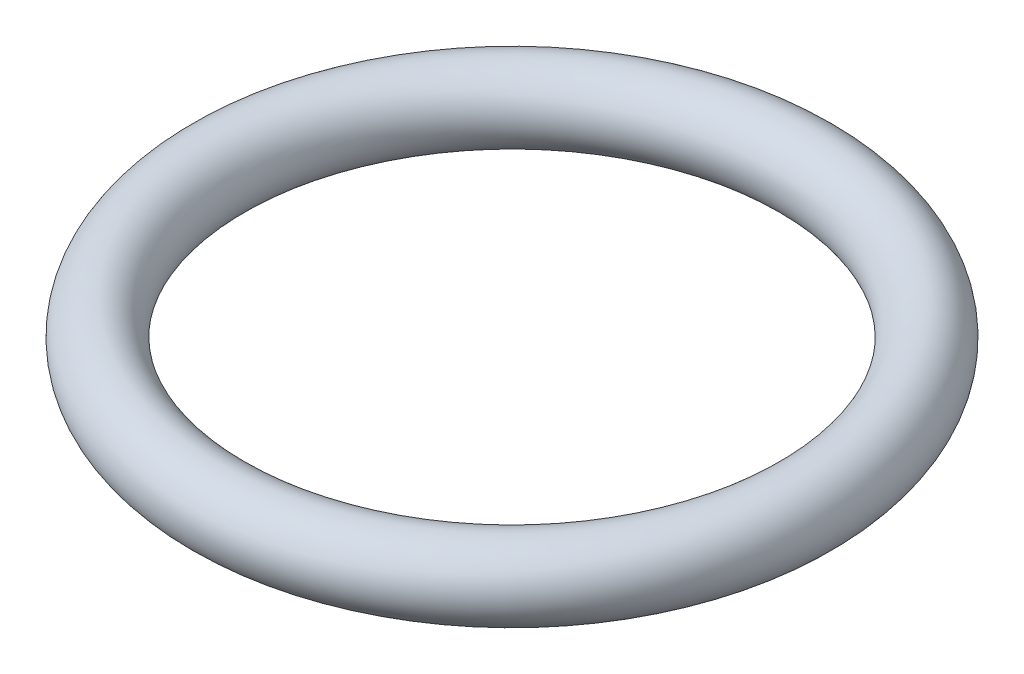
ISO-10303-21;
HEADER;
FILE_DESCRIPTION(('STEP AP214'),'2;1');
FILE_NAME('part.step','',(''),(''),'','','');
FILE_SCHEMA(('AUTOMOTIVE_DESIGN { 1 0 10303 214 1 1 1 1 }'));
ENDSEC;
DATA;
#1=APPLICATION_CONTEXT('core data for automotive mechanical design processes');
#2=APPLICATION_PROTOCOL_DEFINITION('international standard','automotive_design',2000,#1);
#3=PRODUCT_CONTEXT('',#1,'mechanical');
#4=PRODUCT('Part','Part','',(#3));
#5=PRODUCT_RELATED_PRODUCT_CATEGORY('part','',(#4));
#6=PRODUCT_DEFINITION_FORMATION('','',#4);
#7=PRODUCT_DEFINITION_CONTEXT('part definition',#1,'design');
#8=PRODUCT_DEFINITION('design','',#6,#7);
#9=PRODUCT_DEFINITION_SHAPE('','',#8);
#10=(LENGTH_UNIT() NAMED_UNIT(*) SI_UNIT(.MILLI.,.METRE.));
#11=(NAMED_UNIT(*) PLANE_ANGLE_UNIT() SI_UNIT($,.RADIAN.));
#12=(NAMED_UNIT(*) SI_UNIT($,.STERADIAN.) SOLID_ANGLE_UNIT());
#13=UNCERTAINTY_MEASURE_WITH_UNIT(LENGTH_MEASURE(1.E-05),#10,'distance_accuracy_value','');
#14=(GEOMETRIC_REPRESENTATION_CONTEXT(3) GLOBAL_UNCERTAINTY_ASSIGNED_CONTEXT((#13)) GLOBAL_UNIT_ASSIGNED_CONTEXT((#10,
#11,#12)) REPRESENTATION_CONTEXT('',''));
#15=CARTESIAN_POINT('',(0.,0.,0.));
#16=DIRECTION('',(0.,0.,1.));
#17=DIRECTION('',(1.,0.,0.));
#18=AXIS2_PLACEMENT_3D('',#15,#16,#17);
#19=CARTESIAN_POINT('',(0.,0.,0.));
#20=DIRECTION('',(0.,-1.,0.));
#21=DIRECTION('',(0.,0.,-1.));
#22=AXIS2_PLACEMENT_3D('',#19,#20,#21);
#23=TOROIDAL_SURFACE('',#22,21.12,2.62);
#24=CARTESIAN_POINT('',(0.,0.,-23.74));
#25=VERTEX_POINT('',#24);
#26=VERTEX_LOOP('',#25);
#27=FACE_BOUND('',#26,.T.);
#28=ADVANCED_FACE('F35',(#27),#23,.T.);
#29=CLOSED_SHELL('',(#28));
#30=MANIFOLD_SOLID_BREP('B2',#29);
#31=ADVANCED_BREP_SHAPE_REPRESENTATION('',(#18,#30),#14);
#32=SHAPE_DEFINITION_REPRESENTATION(#9,#31);
ENDSEC;
END-ISO-10303-21;
